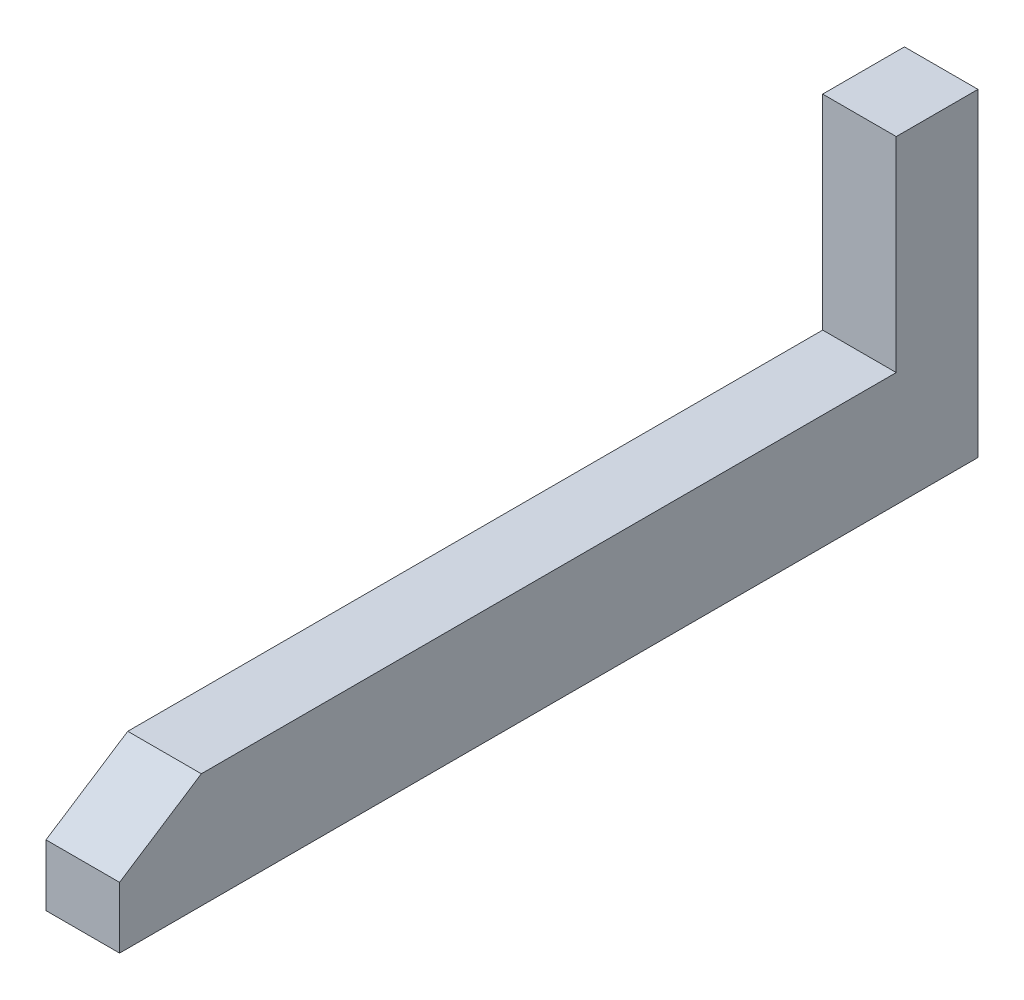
ISO-10303-21;
HEADER;
FILE_DESCRIPTION(('STEP AP214'),'2;1');
FILE_NAME('part.step','',(''),(''),'','','');
FILE_SCHEMA(('AUTOMOTIVE_DESIGN { 1 0 10303 214 1 1 1 1 }'));
ENDSEC;
DATA;
#1=APPLICATION_CONTEXT('core data for automotive mechanical design processes');
#2=APPLICATION_PROTOCOL_DEFINITION('international standard','automotive_design',2000,#1);
#3=PRODUCT_CONTEXT('',#1,'mechanical');
#4=PRODUCT('Part','Part','',(#3));
#5=PRODUCT_RELATED_PRODUCT_CATEGORY('part','',(#4));
#6=PRODUCT_DEFINITION_FORMATION('','',#4);
#7=PRODUCT_DEFINITION_CONTEXT('part definition',#1,'design');
#8=PRODUCT_DEFINITION('design','',#6,#7);
#9=PRODUCT_DEFINITION_SHAPE('','',#8);
#10=(LENGTH_UNIT() NAMED_UNIT(*) SI_UNIT(.MILLI.,.METRE.));
#11=(NAMED_UNIT(*) PLANE_ANGLE_UNIT() SI_UNIT($,.RADIAN.));
#12=(NAMED_UNIT(*) SI_UNIT($,.STERADIAN.) SOLID_ANGLE_UNIT());
#13=UNCERTAINTY_MEASURE_WITH_UNIT(LENGTH_MEASURE(1.E-05),#10,'distance_accuracy_value','');
#14=(GEOMETRIC_REPRESENTATION_CONTEXT(3) GLOBAL_UNCERTAINTY_ASSIGNED_CONTEXT((#13)) GLOBAL_UNIT_ASSIGNED_CONTEXT((#10,
#11,#12)) REPRESENTATION_CONTEXT('',''));
#15=CARTESIAN_POINT('',(0.,0.,0.));
#16=DIRECTION('',(0.,0.,1.));
#17=DIRECTION('',(1.,0.,0.));
#18=AXIS2_PLACEMENT_3D('',#15,#16,#17);
#19=CARTESIAN_POINT('',(1.8,0.,-11.506139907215));
#20=DIRECTION('',(0.,0.,-1.));
#21=DIRECTION('',(-1.,0.,0.));
#22=AXIS2_PLACEMENT_3D('',#19,#20,#21);
#23=PLANE('',#22);
#24=DIRECTION('',(0.,-1.,0.));
#25=VECTOR('',#24,1.);
#26=CARTESIAN_POINT('',(0.,0.,-11.506139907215));
#27=LINE('',#26,#25);
#28=CARTESIAN_POINT('',(0.,5.9286432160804,-11.506139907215));
#29=VERTEX_POINT('',#28);
#30=CARTESIAN_POINT('',(0.,-1.8713567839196,-11.506139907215));
#31=VERTEX_POINT('',#30);
#32=EDGE_CURVE('E134',#29,#31,#27,.T.);
#33=ORIENTED_EDGE('',*,*,#32,.F.);
#34=DIRECTION('',(-1.,0.,0.));
#35=VECTOR('',#34,1.);
#36=CARTESIAN_POINT('',(1.8,5.9286432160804,-11.506139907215));
#37=LINE('',#36,#35);
#38=CARTESIAN_POINT('',(1.8,5.9286432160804,-11.506139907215));
#39=VERTEX_POINT('',#38);
#40=EDGE_CURVE('E11',#39,#29,#37,.T.);
#41=ORIENTED_EDGE('',*,*,#40,.F.);
#42=DIRECTION('',(0.,-1.,0.));
#43=VECTOR('',#42,1.);
#44=CARTESIAN_POINT('',(1.8,0.,-11.506139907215));
#45=LINE('',#44,#43);
#46=CARTESIAN_POINT('',(1.8,-1.8713567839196,-11.506139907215));
#47=VERTEX_POINT('',#46);
#48=EDGE_CURVE('E157',#39,#47,#45,.T.);
#49=ORIENTED_EDGE('',*,*,#48,.T.);
#50=DIRECTION('',(-1.,0.,0.));
#51=VECTOR('',#50,1.);
#52=CARTESIAN_POINT('',(1.8,-1.8713567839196,-11.506139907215));
#53=LINE('',#52,#51);
#54=EDGE_CURVE('E89',#47,#31,#53,.T.);
#55=ORIENTED_EDGE('',*,*,#54,.T.);
#56=EDGE_LOOP('',(#33,#41,#49,#55));
#57=FACE_BOUND('',#56,.T.);
#58=ADVANCED_FACE('F41',(#57),#23,.T.);
#59=CARTESIAN_POINT('',(1.8,5.92864321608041,0.));
#60=DIRECTION('',(0.,1.,0.));
#61=DIRECTION('',(0.,0.,1.));
#62=AXIS2_PLACEMENT_3D('',#59,#60,#61);
#63=PLANE('',#62);
#64=DIRECTION('',(0.,0.,-1.));
#65=VECTOR('',#64,1.);
#66=CARTESIAN_POINT('',(0.,5.92864321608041,0.));
#67=LINE('',#66,#65);
#68=CARTESIAN_POINT('',(0.,5.9286432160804,-9.50613990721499));
#69=VERTEX_POINT('',#68);
#70=EDGE_CURVE('E138',#69,#29,#67,.T.);
#71=ORIENTED_EDGE('',*,*,#70,.F.);
#72=DIRECTION('',(-1.,0.,0.));
#73=VECTOR('',#72,1.);
#74=CARTESIAN_POINT('',(1.8,5.9286432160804,-9.50613990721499));
#75=LINE('',#74,#73);
#76=CARTESIAN_POINT('',(1.8,5.9286432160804,-9.50613990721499));
#77=VERTEX_POINT('',#76);
#78=EDGE_CURVE('E50',#77,#69,#75,.T.);
#79=ORIENTED_EDGE('',*,*,#78,.F.);
#80=DIRECTION('',(0.,0.,-1.));
#81=VECTOR('',#80,1.);
#82=CARTESIAN_POINT('',(1.8,5.92864321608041,0.));
#83=LINE('',#82,#81);
#84=EDGE_CURVE('E180',#77,#39,#83,.T.);
#85=ORIENTED_EDGE('',*,*,#84,.T.);
#86=ORIENTED_EDGE('',*,*,#40,.T.);
#87=EDGE_LOOP('',(#71,#79,#85,#86));
#88=FACE_BOUND('',#87,.T.);
#89=ADVANCED_FACE('F179',(#88),#63,.T.);
#90=CARTESIAN_POINT('',(1.8,0.,-9.50613990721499));
#91=DIRECTION('',(0.,0.,-1.));
#92=DIRECTION('',(-1.,0.,0.));
#93=AXIS2_PLACEMENT_3D('',#90,#91,#92);
#94=PLANE('',#93);
#95=DIRECTION('',(0.,-1.,0.));
#96=VECTOR('',#95,1.);
#97=CARTESIAN_POINT('',(0.,0.,-9.50613990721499));
#98=LINE('',#97,#96);
#99=CARTESIAN_POINT('',(0.,0.928643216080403,-9.50613990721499));
#100=VERTEX_POINT('',#99);
#101=EDGE_CURVE('E142',#69,#100,#98,.T.);
#102=ORIENTED_EDGE('',*,*,#101,.T.);
#103=DIRECTION('',(-1.,0.,0.));
#104=VECTOR('',#103,1.);
#105=CARTESIAN_POINT('',(1.8,0.928643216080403,-9.50613990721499));
#106=LINE('',#105,#104);
#107=CARTESIAN_POINT('',(1.8,0.928643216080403,-9.50613990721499));
#108=VERTEX_POINT('',#107);
#109=EDGE_CURVE('E164',#108,#100,#106,.T.);
#110=ORIENTED_EDGE('',*,*,#109,.F.);
#111=DIRECTION('',(0.,-1.,0.));
#112=VECTOR('',#111,1.);
#113=CARTESIAN_POINT('',(1.8,0.,-9.50613990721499));
#114=LINE('',#113,#112);
#115=EDGE_CURVE('E128',#77,#108,#114,.T.);
#116=ORIENTED_EDGE('',*,*,#115,.F.);
#117=ORIENTED_EDGE('',*,*,#78,.T.);
#118=EDGE_LOOP('',(#102,#110,#116,#117));
#119=FACE_BOUND('',#118,.T.);
#120=ADVANCED_FACE('F170',(#119),#94,.F.);
#121=CARTESIAN_POINT('',(1.8,0.928643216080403,0.));
#122=DIRECTION('',(0.,1.,0.));
#123=DIRECTION('',(0.,0.,1.));
#124=AXIS2_PLACEMENT_3D('',#121,#122,#123);
#125=PLANE('',#124);
#126=DIRECTION('',(0.,0.,-1.));
#127=VECTOR('',#126,1.);
#128=CARTESIAN_POINT('',(0.,0.928643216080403,0.));
#129=LINE('',#128,#127);
#130=CARTESIAN_POINT('',(0.,0.928643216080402,7.49386009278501));
#131=VERTEX_POINT('',#130);
#132=EDGE_CURVE('E146',#131,#100,#129,.T.);
#133=ORIENTED_EDGE('',*,*,#132,.F.);
#134=DIRECTION('',(-1.,0.,0.));
#135=VECTOR('',#134,1.);
#136=CARTESIAN_POINT('',(1.8,0.928643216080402,7.49386009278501));
#137=LINE('',#136,#135);
#138=CARTESIAN_POINT('',(1.8,0.928643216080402,7.49386009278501));
#139=VERTEX_POINT('',#138);
#140=EDGE_CURVE('E114',#139,#131,#137,.T.);
#141=ORIENTED_EDGE('',*,*,#140,.F.);
#142=DIRECTION('',(0.,0.,-1.));
#143=VECTOR('',#142,1.);
#144=CARTESIAN_POINT('',(1.8,0.928643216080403,0.));
#145=LINE('',#144,#143);
#146=EDGE_CURVE('E124',#139,#108,#145,.T.);
#147=ORIENTED_EDGE('',*,*,#146,.T.);
#148=ORIENTED_EDGE('',*,*,#109,.T.);
#149=EDGE_LOOP('',(#133,#141,#147,#148));
#150=FACE_BOUND('',#149,.T.);
#151=ADVANCED_FACE('F190',(#150),#125,.T.);
#152=CARTESIAN_POINT('',(1.8,4.07708420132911,2.65010473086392));
#153=DIRECTION('',(0.,0.838443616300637,0.544988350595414));
#154=DIRECTION('',(0.,-0.544988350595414,0.838443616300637));
#155=AXIS2_PLACEMENT_3D('',#152,#153,#154);
#156=PLANE('',#155);
#157=DIRECTION('',(0.,0.544988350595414,-0.838443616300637));
#158=VECTOR('',#157,1.);
#159=CARTESIAN_POINT('',(0.,4.07708420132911,2.65010473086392));
#160=LINE('',#159,#158);
#161=CARTESIAN_POINT('',(0.,-0.371356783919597,9.49386009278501));
#162=VERTEX_POINT('',#161);
#163=EDGE_CURVE('E112',#162,#131,#160,.T.);
#164=ORIENTED_EDGE('',*,*,#163,.F.);
#165=DIRECTION('',(-1.,0.,0.));
#166=VECTOR('',#165,1.);
#167=CARTESIAN_POINT('',(1.8,-0.371356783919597,9.49386009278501));
#168=LINE('',#167,#166);
#169=CARTESIAN_POINT('',(1.8,-0.371356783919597,9.49386009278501));
#170=VERTEX_POINT('',#169);
#171=EDGE_CURVE('E106',#170,#162,#168,.T.);
#172=ORIENTED_EDGE('',*,*,#171,.F.);
#173=DIRECTION('',(0.,0.544988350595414,-0.838443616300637));
#174=VECTOR('',#173,1.);
#175=CARTESIAN_POINT('',(1.8,4.07708420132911,2.65010473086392));
#176=LINE('',#175,#174);
#177=EDGE_CURVE('E110',#170,#139,#176,.T.);
#178=ORIENTED_EDGE('',*,*,#177,.T.);
#179=ORIENTED_EDGE('',*,*,#140,.T.);
#180=EDGE_LOOP('',(#164,#172,#178,#179));
#181=FACE_BOUND('',#180,.T.);
#182=ADVANCED_FACE('F108',(#181),#156,.T.);
#183=CARTESIAN_POINT('',(1.8,0.,9.49386009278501));
#184=DIRECTION('',(0.,0.,-1.));
#185=DIRECTION('',(-1.,0.,0.));
#186=AXIS2_PLACEMENT_3D('',#183,#184,#185);
#187=PLANE('',#186);
#188=DIRECTION('',(0.,-1.,0.));
#189=VECTOR('',#188,1.);
#190=CARTESIAN_POINT('',(0.,0.,9.49386009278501));
#191=LINE('',#190,#189);
#192=CARTESIAN_POINT('',(0.,-1.8713567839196,9.49386009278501));
#193=VERTEX_POINT('',#192);
#194=EDGE_CURVE('E82',#162,#193,#191,.T.);
#195=ORIENTED_EDGE('',*,*,#194,.T.);
#196=DIRECTION('',(-1.,0.,0.));
#197=VECTOR('',#196,1.);
#198=CARTESIAN_POINT('',(1.8,-1.8713567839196,9.49386009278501));
#199=LINE('',#198,#197);
#200=CARTESIAN_POINT('',(1.8,-1.8713567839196,9.49386009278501));
#201=VERTEX_POINT('',#200);
#202=EDGE_CURVE('E115',#201,#193,#199,.T.);
#203=ORIENTED_EDGE('',*,*,#202,.F.);
#204=DIRECTION('',(0.,-1.,0.));
#205=VECTOR('',#204,1.);
#206=CARTESIAN_POINT('',(1.8,0.,9.49386009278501));
#207=LINE('',#206,#205);
#208=EDGE_CURVE('E117',#170,#201,#207,.T.);
#209=ORIENTED_EDGE('',*,*,#208,.F.);
#210=ORIENTED_EDGE('',*,*,#171,.T.);
#211=EDGE_LOOP('',(#195,#203,#209,#210));
#212=FACE_BOUND('',#211,.T.);
#213=ADVANCED_FACE('F118',(#212),#187,.F.);
#214=CARTESIAN_POINT('',(1.8,-1.8713567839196,0.));
#215=DIRECTION('',(0.,1.,0.));
#216=DIRECTION('',(0.,0.,1.));
#217=AXIS2_PLACEMENT_3D('',#214,#215,#216);
#218=PLANE('',#217);
#219=DIRECTION('',(0.,0.,-1.));
#220=VECTOR('',#219,1.);
#221=CARTESIAN_POINT('',(0.,-1.8713567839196,0.));
#222=LINE('',#221,#220);
#223=EDGE_CURVE('E154',#193,#31,#222,.T.);
#224=ORIENTED_EDGE('',*,*,#223,.T.);
#225=ORIENTED_EDGE('',*,*,#54,.F.);
#226=DIRECTION('',(0.,0.,-1.));
#227=VECTOR('',#226,1.);
#228=CARTESIAN_POINT('',(1.8,-1.8713567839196,0.));
#229=LINE('',#228,#227);
#230=EDGE_CURVE('E58',#201,#47,#229,.T.);
#231=ORIENTED_EDGE('',*,*,#230,.F.);
#232=ORIENTED_EDGE('',*,*,#202,.T.);
#233=EDGE_LOOP('',(#224,#225,#231,#232));
#234=FACE_BOUND('',#233,.T.);
#235=ADVANCED_FACE('F183',(#234),#218,.F.);
#236=CARTESIAN_POINT('',(1.8,0.,0.));
#237=DIRECTION('',(1.,0.,0.));
#238=DIRECTION('',(0.,0.,-1.));
#239=AXIS2_PLACEMENT_3D('',#236,#237,#238);
#240=PLANE('',#239);
#241=ORIENTED_EDGE('',*,*,#48,.F.);
#242=ORIENTED_EDGE('',*,*,#84,.F.);
#243=ORIENTED_EDGE('',*,*,#115,.T.);
#244=ORIENTED_EDGE('',*,*,#146,.F.);
#245=ORIENTED_EDGE('',*,*,#177,.F.);
#246=ORIENTED_EDGE('',*,*,#208,.T.);
#247=ORIENTED_EDGE('',*,*,#230,.T.);
#248=EDGE_LOOP('',(#241,#242,#243,#244,#245,#246,#247));
#249=FACE_BOUND('',#248,.T.);
#250=ADVANCED_FACE('F122',(#249),#240,.T.);
#251=CARTESIAN_POINT('',(0.,0.,0.));
#252=DIRECTION('',(1.,0.,0.));
#253=DIRECTION('',(0.,0.,-1.));
#254=AXIS2_PLACEMENT_3D('',#251,#252,#253);
#255=PLANE('',#254);
#256=ORIENTED_EDGE('',*,*,#32,.T.);
#257=ORIENTED_EDGE('',*,*,#223,.F.);
#258=ORIENTED_EDGE('',*,*,#194,.F.);
#259=ORIENTED_EDGE('',*,*,#163,.T.);
#260=ORIENTED_EDGE('',*,*,#132,.T.);
#261=ORIENTED_EDGE('',*,*,#101,.F.);
#262=ORIENTED_EDGE('',*,*,#70,.T.);
#263=EDGE_LOOP('',(#256,#257,#258,#259,#260,#261,#262));
#264=FACE_BOUND('',#263,.T.);
#265=ADVANCED_FACE('F177',(#264),#255,.F.);
#266=CLOSED_SHELL('',(#58,#89,#120,#151,#182,#213,#235,#250,#265));
#267=MANIFOLD_SOLID_BREP('B2',#266);
#268=ADVANCED_BREP_SHAPE_REPRESENTATION('',(#18,#267),#14);
#269=SHAPE_DEFINITION_REPRESENTATION(#9,#268);
ENDSEC;
END-ISO-10303-21;
